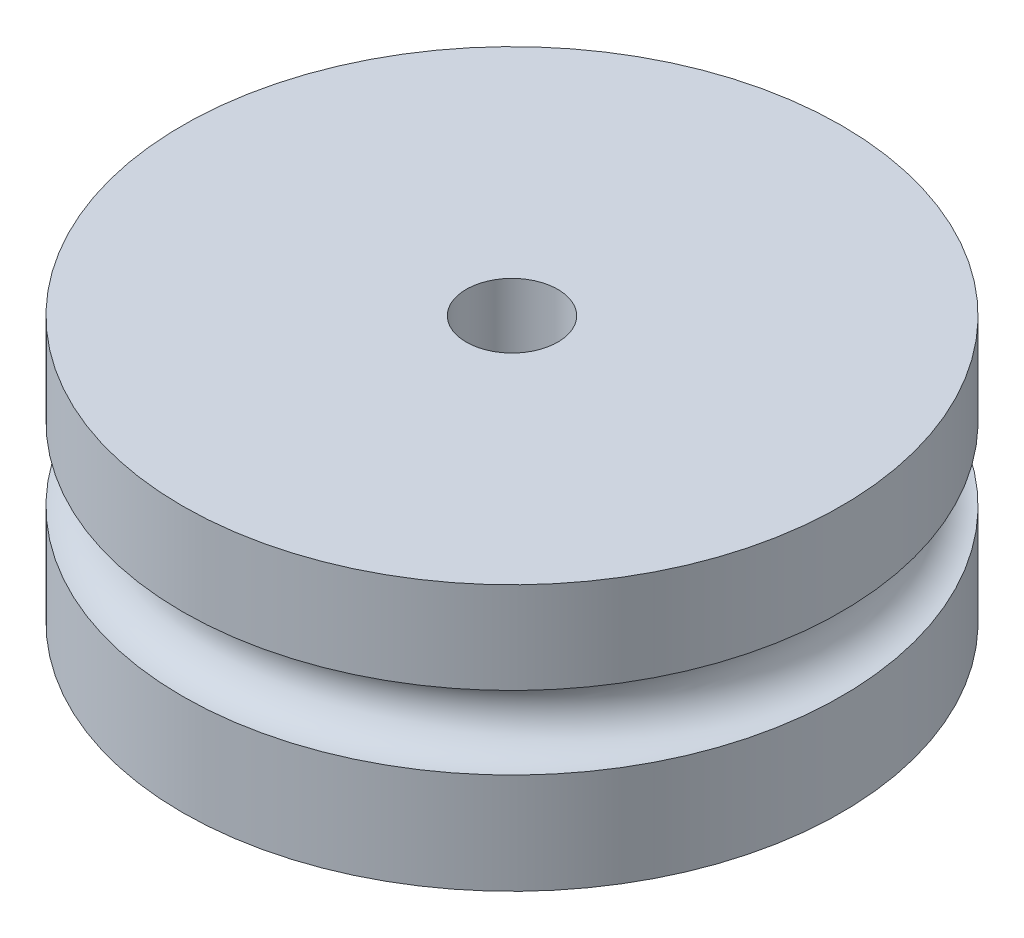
ISO-10303-21;
HEADER;
FILE_DESCRIPTION(('STEP AP214'),'2;1');
FILE_NAME('part.step','',(''),(''),'','','');
FILE_SCHEMA(('AUTOMOTIVE_DESIGN { 1 0 10303 214 1 1 1 1 }'));
ENDSEC;
DATA;
#1=APPLICATION_CONTEXT('core data for automotive mechanical design processes');
#2=APPLICATION_PROTOCOL_DEFINITION('international standard','automotive_design',2000,#1);
#3=PRODUCT_CONTEXT('',#1,'mechanical');
#4=PRODUCT('Part','Part','',(#3));
#5=PRODUCT_RELATED_PRODUCT_CATEGORY('part','',(#4));
#6=PRODUCT_DEFINITION_FORMATION('','',#4);
#7=PRODUCT_DEFINITION_CONTEXT('part definition',#1,'design');
#8=PRODUCT_DEFINITION('design','',#6,#7);
#9=PRODUCT_DEFINITION_SHAPE('','',#8);
#10=(LENGTH_UNIT() NAMED_UNIT(*) SI_UNIT(.MILLI.,.METRE.));
#11=(NAMED_UNIT(*) PLANE_ANGLE_UNIT() SI_UNIT($,.RADIAN.));
#12=(NAMED_UNIT(*) SI_UNIT($,.STERADIAN.) SOLID_ANGLE_UNIT());
#13=UNCERTAINTY_MEASURE_WITH_UNIT(LENGTH_MEASURE(1.E-05),#10,'distance_accuracy_value','');
#14=(GEOMETRIC_REPRESENTATION_CONTEXT(3) GLOBAL_UNCERTAINTY_ASSIGNED_CONTEXT((#13)) GLOBAL_UNIT_ASSIGNED_CONTEXT((#10,
#11,#12)) REPRESENTATION_CONTEXT('',''));
#15=CARTESIAN_POINT('',(0.,0.,0.));
#16=DIRECTION('',(0.,0.,1.));
#17=DIRECTION('',(1.,0.,0.));
#18=AXIS2_PLACEMENT_3D('',#15,#16,#17);
#19=CARTESIAN_POINT('',(0.,7.25,0.));
#20=DIRECTION('',(0.,-1.,0.));
#21=DIRECTION('',(0.,0.,-1.));
#22=AXIS2_PLACEMENT_3D('',#19,#20,#21);
#23=CYLINDRICAL_SURFACE('',#22,18.);
#24=CARTESIAN_POINT('',(0.,2.25,0.));
#25=DIRECTION('',(0.,-1.,0.));
#26=DIRECTION('',(0.,0.,-1.));
#27=AXIS2_PLACEMENT_3D('',#24,#25,#26);
#28=CIRCLE('',#27,18.);
#29=CARTESIAN_POINT('',(0.,2.25,-18.));
#30=VERTEX_POINT('',#29);
#31=EDGE_CURVE('E51',#30,#30,#28,.F.);
#32=CARTESIAN_POINT('',(0.,7.25,0.));
#33=DIRECTION('',(0.,1.,0.));
#34=DIRECTION('',(0.,0.,1.));
#35=AXIS2_PLACEMENT_3D('',#32,#33,#34);
#36=CIRCLE('',#35,18.);
#37=CARTESIAN_POINT('',(0.,7.25,-18.));
#38=VERTEX_POINT('',#37);
#39=EDGE_CURVE('E10',#38,#38,#36,.T.);
#40=CARTESIAN_POINT('',(0.,2.25,-18.));
#41=CARTESIAN_POINT('',(0.,2.30208333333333,-18.));
#42=CARTESIAN_POINT('',(0.,2.35416666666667,-18.));
#43=CARTESIAN_POINT('',(0.,2.45833333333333,-18.));
#44=CARTESIAN_POINT('',(0.,2.51041666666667,-18.));
#45=CARTESIAN_POINT('',(0.,2.61458333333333,-18.));
#46=CARTESIAN_POINT('',(0.,2.66666666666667,-18.));
#47=CARTESIAN_POINT('',(0.,2.77083333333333,-18.));
#48=CARTESIAN_POINT('',(0.,2.82291666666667,-18.));
#49=CARTESIAN_POINT('',(0.,2.92708333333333,-18.));
#50=CARTESIAN_POINT('',(0.,2.97916666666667,-18.));
#51=CARTESIAN_POINT('',(0.,3.08333333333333,-18.));
#52=CARTESIAN_POINT('',(0.,3.13541666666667,-18.));
#53=CARTESIAN_POINT('',(0.,3.23958333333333,-18.));
#54=CARTESIAN_POINT('',(0.,3.29166666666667,-18.));
#55=CARTESIAN_POINT('',(0.,3.39583333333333,-18.));
#56=CARTESIAN_POINT('',(0.,3.44791666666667,-18.));
#57=CARTESIAN_POINT('',(0.,3.55208333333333,-18.));
#58=CARTESIAN_POINT('',(0.,3.60416666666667,-18.));
#59=CARTESIAN_POINT('',(0.,3.70833333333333,-18.));
#60=CARTESIAN_POINT('',(0.,3.76041666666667,-18.));
#61=CARTESIAN_POINT('',(0.,3.86458333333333,-18.));
#62=CARTESIAN_POINT('',(0.,3.91666666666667,-18.));
#63=CARTESIAN_POINT('',(0.,4.02083333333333,-18.));
#64=CARTESIAN_POINT('',(0.,4.07291666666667,-18.));
#65=CARTESIAN_POINT('',(0.,4.17708333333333,-18.));
#66=CARTESIAN_POINT('',(0.,4.22916666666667,-18.));
#67=CARTESIAN_POINT('',(0.,4.33333333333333,-18.));
#68=CARTESIAN_POINT('',(0.,4.38541666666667,-18.));
#69=CARTESIAN_POINT('',(0.,4.48958333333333,-18.));
#70=CARTESIAN_POINT('',(0.,4.54166666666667,-18.));
#71=CARTESIAN_POINT('',(0.,4.64583333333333,-18.));
#72=CARTESIAN_POINT('',(0.,4.69791666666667,-18.));
#73=CARTESIAN_POINT('',(0.,4.80208333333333,-18.));
#74=CARTESIAN_POINT('',(0.,4.85416666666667,-18.));
#75=CARTESIAN_POINT('',(0.,4.95833333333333,-18.));
#76=CARTESIAN_POINT('',(0.,5.01041666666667,-18.));
#77=CARTESIAN_POINT('',(0.,5.11458333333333,-18.));
#78=CARTESIAN_POINT('',(0.,5.16666666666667,-18.));
#79=CARTESIAN_POINT('',(0.,5.27083333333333,-18.));
#80=CARTESIAN_POINT('',(0.,5.32291666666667,-18.));
#81=CARTESIAN_POINT('',(0.,5.42708333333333,-18.));
#82=CARTESIAN_POINT('',(0.,5.47916666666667,-18.));
#83=CARTESIAN_POINT('',(0.,5.58333333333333,-18.));
#84=CARTESIAN_POINT('',(0.,5.63541666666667,-18.));
#85=CARTESIAN_POINT('',(0.,5.73958333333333,-18.));
#86=CARTESIAN_POINT('',(0.,5.79166666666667,-18.));
#87=CARTESIAN_POINT('',(0.,5.89583333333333,-18.));
#88=CARTESIAN_POINT('',(0.,5.94791666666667,-18.));
#89=CARTESIAN_POINT('',(0.,6.05208333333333,-18.));
#90=CARTESIAN_POINT('',(0.,6.10416666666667,-18.));
#91=CARTESIAN_POINT('',(0.,6.20833333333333,-18.));
#92=CARTESIAN_POINT('',(0.,6.26041666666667,-18.));
#93=CARTESIAN_POINT('',(0.,6.36458333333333,-18.));
#94=CARTESIAN_POINT('',(0.,6.41666666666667,-18.));
#95=CARTESIAN_POINT('',(0.,6.52083333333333,-18.));
#96=CARTESIAN_POINT('',(0.,6.57291666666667,-18.));
#97=CARTESIAN_POINT('',(0.,6.67708333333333,-18.));
#98=CARTESIAN_POINT('',(0.,6.72916666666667,-18.));
#99=CARTESIAN_POINT('',(0.,6.83333333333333,-18.));
#100=CARTESIAN_POINT('',(0.,6.88541666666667,-18.));
#101=CARTESIAN_POINT('',(0.,6.98958333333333,-18.));
#102=CARTESIAN_POINT('',(0.,7.04166666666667,-18.));
#103=CARTESIAN_POINT('',(0.,7.14583333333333,-18.));
#104=CARTESIAN_POINT('',(0.,7.19791666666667,-18.));
#105=CARTESIAN_POINT('',(0.,7.25,-18.));
#106=B_SPLINE_CURVE_WITH_KNOTS('',3,(#40,#41,#42,#43,#44,#45,#46,#47,#48,#49,#50,#51,#52,#53,
#54,#55,#56,#57,#58,#59,#60,#61,#62,#63,#64,#65,#66,#67,#68,#69,#70,#71,#72,#73,#74,#75,#76,#77,
#78,#79,#80,#81,#82,#83,#84,#85,#86,#87,#88,#89,#90,#91,#92,#93,#94,#95,#96,#97,#98,#99,#100,
#101,#102,#103,#104,#105),.UNSPECIFIED.,.F.,.F.,(4,2,2,2,2,2,2,2,2,2,2,2,2,2,2,2,2,2,2,2,2,2,2,
2,2,2,2,2,2,2,2,2,4),(0.,0.15625,0.3125,0.46875,0.625000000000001,0.781250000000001,
0.937500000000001,1.09375,1.25,1.40625,1.5625,1.71875,1.875,2.03125,2.1875,2.34375,2.5,2.65625,
2.8125,2.96875,3.125,3.28125,3.4375,3.59375,3.75,3.90625,4.0625,4.21875,4.375,4.53125,4.6875,
4.84375,5.),.UNSPECIFIED.);
#107=EDGE_CURVE('BSEAM47',#30,#38,#106,.T.);
#108=ORIENTED_EDGE('',*,*,#31,.T.);
#109=ORIENTED_EDGE('',*,*,#39,.F.);
#110=ORIENTED_EDGE('',*,*,#107,.T.);
#111=ORIENTED_EDGE('',*,*,#107,.F.);
#112=EDGE_LOOP('',(#108,#110,#109,#111));
#113=FACE_BOUND('',#112,.T.);
#114=ADVANCED_FACE('F47',(#113),#23,.T.);
#115=CARTESIAN_POINT('',(0.,7.25,0.));
#116=DIRECTION('',(0.,1.,0.));
#117=DIRECTION('',(0.,0.,1.));
#118=AXIS2_PLACEMENT_3D('',#115,#116,#117);
#119=PLANE('',#118);
#120=CARTESIAN_POINT('',(0.,7.25,0.));
#121=DIRECTION('',(0.,1.,0.));
#122=DIRECTION('',(0.,0.,1.));
#123=AXIS2_PLACEMENT_3D('',#120,#121,#122);
#124=CIRCLE('',#123,2.5);
#125=CARTESIAN_POINT('',(0.,7.25,2.5));
#126=VERTEX_POINT('',#125);
#127=EDGE_CURVE('E75',#126,#126,#124,.T.);
#128=ORIENTED_EDGE('',*,*,#127,.F.);
#129=EDGE_LOOP('',(#128));
#130=FACE_BOUND('',#129,.T.);
#131=ORIENTED_EDGE('',*,*,#39,.T.);
#132=EDGE_LOOP('',(#131));
#133=FACE_BOUND('',#132,.T.);
#134=ADVANCED_FACE('F84',(#130,#133),#119,.T.);
#135=CARTESIAN_POINT('',(0.,0.249999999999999,0.));
#136=DIRECTION('',(0.,1.,0.));
#137=DIRECTION('',(0.,0.,1.));
#138=AXIS2_PLACEMENT_3D('',#135,#136,#137);
#139=TOROIDAL_SURFACE('',#138,18.,2.);
#140=CARTESIAN_POINT('',(0.,-1.75,0.));
#141=DIRECTION('',(0.,1.,0.));
#142=DIRECTION('',(0.,0.,1.));
#143=AXIS2_PLACEMENT_3D('',#140,#141,#142);
#144=CIRCLE('',#143,18.);
#145=CARTESIAN_POINT('',(0.,-1.75,-18.));
#146=VERTEX_POINT('',#145);
#147=EDGE_CURVE('E66',#146,#146,#144,.F.);
#148=ORIENTED_EDGE('',*,*,#147,.F.);
#149=EDGE_LOOP('',(#148));
#150=FACE_BOUND('',#149,.T.);
#151=ORIENTED_EDGE('',*,*,#31,.F.);
#152=EDGE_LOOP('',(#151));
#153=FACE_BOUND('',#152,.T.);
#154=ADVANCED_FACE('F86',(#150,#153),#139,.F.);
#155=CARTESIAN_POINT('',(0.,-7.25,0.));
#156=DIRECTION('',(0.,1.,0.));
#157=DIRECTION('',(0.,0.,1.));
#158=AXIS2_PLACEMENT_3D('',#155,#156,#157);
#159=PLANE('',#158);
#160=CARTESIAN_POINT('',(0.,-7.25,0.));
#161=DIRECTION('',(0.,1.,0.));
#162=DIRECTION('',(0.,0.,1.));
#163=AXIS2_PLACEMENT_3D('',#160,#161,#162);
#164=CIRCLE('',#163,2.5);
#165=CARTESIAN_POINT('',(0.,-7.25,2.5));
#166=VERTEX_POINT('',#165);
#167=EDGE_CURVE('E64',#166,#166,#164,.T.);
#168=ORIENTED_EDGE('',*,*,#167,.T.);
#169=EDGE_LOOP('',(#168));
#170=FACE_BOUND('',#169,.T.);
#171=CARTESIAN_POINT('',(0.,-7.25,0.));
#172=DIRECTION('',(0.,1.,0.));
#173=DIRECTION('',(0.,0.,1.));
#174=AXIS2_PLACEMENT_3D('',#171,#172,#173);
#175=CIRCLE('',#174,18.);
#176=CARTESIAN_POINT('',(0.,-7.25,-18.));
#177=VERTEX_POINT('',#176);
#178=EDGE_CURVE('E56',#177,#177,#175,.T.);
#179=ORIENTED_EDGE('',*,*,#178,.F.);
#180=EDGE_LOOP('',(#179));
#181=FACE_BOUND('',#180,.T.);
#182=ADVANCED_FACE('F93',(#170,#181),#159,.F.);
#183=CARTESIAN_POINT('',(0.,-1.75,-18.));
#184=CARTESIAN_POINT('',(0.,-1.80729166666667,-18.));
#185=CARTESIAN_POINT('',(0.,-1.86458333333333,-18.));
#186=CARTESIAN_POINT('',(0.,-1.97916666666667,-18.));
#187=CARTESIAN_POINT('',(0.,-2.03645833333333,-18.));
#188=CARTESIAN_POINT('',(0.,-2.15104166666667,-18.));
#189=CARTESIAN_POINT('',(0.,-2.20833333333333,-18.));
#190=CARTESIAN_POINT('',(0.,-2.32291666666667,-18.));
#191=CARTESIAN_POINT('',(0.,-2.38020833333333,-18.));
#192=CARTESIAN_POINT('',(0.,-2.49479166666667,-18.));
#193=CARTESIAN_POINT('',(0.,-2.55208333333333,-18.));
#194=CARTESIAN_POINT('',(0.,-2.66666666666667,-18.));
#195=CARTESIAN_POINT('',(0.,-2.72395833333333,-18.));
#196=CARTESIAN_POINT('',(0.,-2.83854166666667,-18.));
#197=CARTESIAN_POINT('',(0.,-2.89583333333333,-18.));
#198=CARTESIAN_POINT('',(0.,-3.01041666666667,-18.));
#199=CARTESIAN_POINT('',(0.,-3.06770833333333,-18.));
#200=CARTESIAN_POINT('',(0.,-3.18229166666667,-18.));
#201=CARTESIAN_POINT('',(0.,-3.23958333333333,-18.));
#202=CARTESIAN_POINT('',(0.,-3.35416666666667,-18.));
#203=CARTESIAN_POINT('',(0.,-3.41145833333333,-18.));
#204=CARTESIAN_POINT('',(0.,-3.52604166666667,-18.));
#205=CARTESIAN_POINT('',(0.,-3.58333333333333,-18.));
#206=CARTESIAN_POINT('',(0.,-3.69791666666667,-18.));
#207=CARTESIAN_POINT('',(0.,-3.75520833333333,-18.));
#208=CARTESIAN_POINT('',(0.,-3.86979166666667,-18.));
#209=CARTESIAN_POINT('',(0.,-3.92708333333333,-18.));
#210=CARTESIAN_POINT('',(0.,-4.04166666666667,-18.));
#211=CARTESIAN_POINT('',(0.,-4.09895833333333,-18.));
#212=CARTESIAN_POINT('',(0.,-4.21354166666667,-18.));
#213=CARTESIAN_POINT('',(0.,-4.27083333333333,-18.));
#214=CARTESIAN_POINT('',(0.,-4.38541666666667,-18.));
#215=CARTESIAN_POINT('',(0.,-4.44270833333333,-18.));
#216=CARTESIAN_POINT('',(0.,-4.55729166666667,-18.));
#217=CARTESIAN_POINT('',(0.,-4.61458333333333,-18.));
#218=CARTESIAN_POINT('',(0.,-4.72916666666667,-18.));
#219=CARTESIAN_POINT('',(0.,-4.78645833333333,-18.));
#220=CARTESIAN_POINT('',(0.,-4.90104166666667,-18.));
#221=CARTESIAN_POINT('',(0.,-4.95833333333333,-18.));
#222=CARTESIAN_POINT('',(0.,-5.07291666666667,-18.));
#223=CARTESIAN_POINT('',(0.,-5.13020833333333,-18.));
#224=CARTESIAN_POINT('',(0.,-5.24479166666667,-18.));
#225=CARTESIAN_POINT('',(0.,-5.30208333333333,-18.));
#226=CARTESIAN_POINT('',(0.,-5.41666666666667,-18.));
#227=CARTESIAN_POINT('',(0.,-5.47395833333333,-18.));
#228=CARTESIAN_POINT('',(0.,-5.58854166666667,-18.));
#229=CARTESIAN_POINT('',(0.,-5.64583333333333,-18.));
#230=CARTESIAN_POINT('',(0.,-5.76041666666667,-18.));
#231=CARTESIAN_POINT('',(0.,-5.81770833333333,-18.));
#232=CARTESIAN_POINT('',(0.,-5.93229166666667,-18.));
#233=CARTESIAN_POINT('',(0.,-5.98958333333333,-18.));
#234=CARTESIAN_POINT('',(0.,-6.10416666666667,-18.));
#235=CARTESIAN_POINT('',(0.,-6.16145833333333,-18.));
#236=CARTESIAN_POINT('',(0.,-6.27604166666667,-18.));
#237=CARTESIAN_POINT('',(0.,-6.33333333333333,-18.));
#238=CARTESIAN_POINT('',(0.,-6.44791666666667,-18.));
#239=CARTESIAN_POINT('',(0.,-6.50520833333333,-18.));
#240=CARTESIAN_POINT('',(0.,-6.61979166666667,-18.));
#241=CARTESIAN_POINT('',(0.,-6.67708333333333,-18.));
#242=CARTESIAN_POINT('',(0.,-6.79166666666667,-18.));
#243=CARTESIAN_POINT('',(0.,-6.84895833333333,-18.));
#244=CARTESIAN_POINT('',(0.,-6.96354166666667,-18.));
#245=CARTESIAN_POINT('',(0.,-7.02083333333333,-18.));
#246=CARTESIAN_POINT('',(0.,-7.13541666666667,-18.));
#247=CARTESIAN_POINT('',(0.,-7.19270833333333,-18.));
#248=CARTESIAN_POINT('',(0.,-7.25,-18.));
#249=B_SPLINE_CURVE_WITH_KNOTS('',3,(#183,#184,#185,#186,#187,#188,#189,#190,#191,#192,#193,
#194,#195,#196,#197,#198,#199,#200,#201,#202,#203,#204,#205,#206,#207,#208,#209,#210,#211,#212,
#213,#214,#215,#216,#217,#218,#219,#220,#221,#222,#223,#224,#225,#226,#227,#228,#229,#230,#231,
#232,#233,#234,#235,#236,#237,#238,#239,#240,#241,#242,#243,#244,#245,#246,#247,#248),
.UNSPECIFIED.,.F.,.F.,(4,2,2,2,2,2,2,2,2,2,2,2,2,2,2,2,2,2,2,2,2,2,2,2,2,2,2,2,2,2,2,2,4),(0.,
0.171875,0.34375,0.515625,0.687500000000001,0.859375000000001,1.03125,1.203125,1.375,1.546875,
1.71875,1.890625,2.0625,2.234375,2.40625,2.578125,2.75,2.921875,3.09375,3.265625,3.4375,
3.609375,3.78125,3.953125,4.125,4.296875,4.46875,4.640625,4.8125,4.984375,5.15625,5.328125,5.5),.UNSPECIFIED.);
#250=EDGE_CURVE('BSEAM49',#146,#177,#249,.T.);
#251=ORIENTED_EDGE('',*,*,#147,.T.);
#252=ORIENTED_EDGE('',*,*,#178,.T.);
#253=ORIENTED_EDGE('',*,*,#250,.T.);
#254=ORIENTED_EDGE('',*,*,#250,.F.);
#255=EDGE_LOOP('',(#251,#253,#252,#254));
#256=FACE_BOUND('',#255,.T.);
#257=ADVANCED_FACE('F49',(#256),#23,.T.);
#258=CARTESIAN_POINT('',(0.,7.25,0.));
#259=DIRECTION('',(0.,1.,0.));
#260=DIRECTION('',(0.,0.,1.));
#261=AXIS2_PLACEMENT_3D('',#258,#259,#260);
#262=CYLINDRICAL_SURFACE('',#261,2.5);
#263=ORIENTED_EDGE('',*,*,#167,.F.);
#264=EDGE_LOOP('',(#263));
#265=FACE_BOUND('',#264,.T.);
#266=ORIENTED_EDGE('',*,*,#127,.T.);
#267=EDGE_LOOP('',(#266));
#268=FACE_BOUND('',#267,.T.);
#269=ADVANCED_FACE('F82',(#265,#268),#262,.F.);
#270=CLOSED_SHELL('',(#114,#134,#154,#182,#257,#269));
#271=MANIFOLD_SOLID_BREP('B2',#270);
#272=ADVANCED_BREP_SHAPE_REPRESENTATION('',(#18,#271),#14);
#273=SHAPE_DEFINITION_REPRESENTATION(#9,#272);
ENDSEC;
END-ISO-10303-21;
